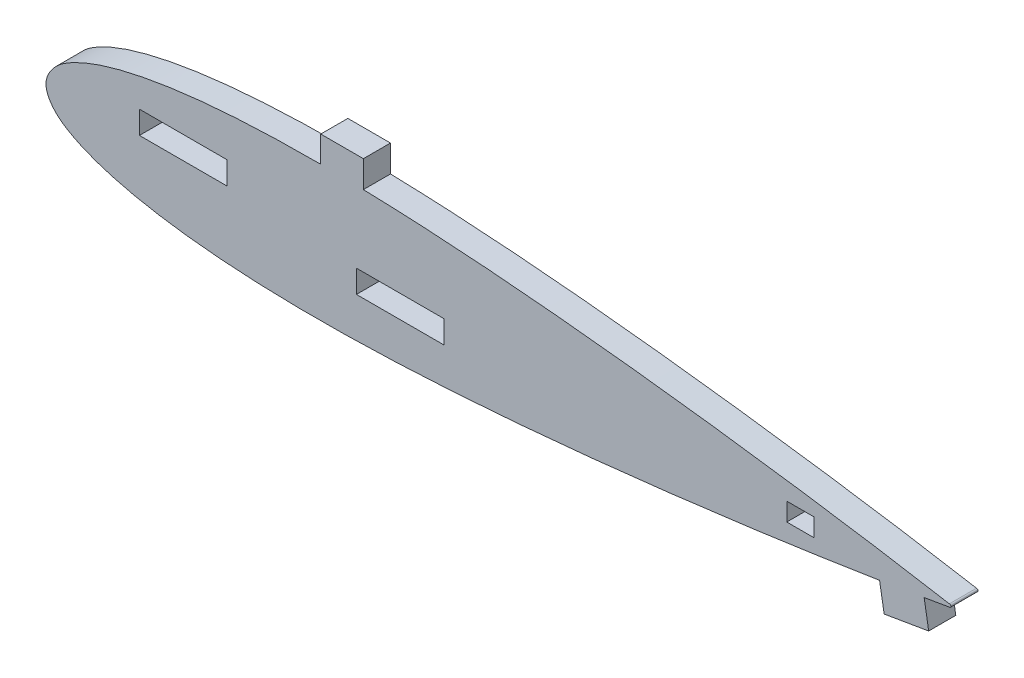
from build123d import *

# Parameters (mm, degrees)
SALIENTE_EXTRUIR1_DEPTH = 3
CROQUIS2_W              = 3
CROQUIS2_H              = 2
CROQUIS2_W_2            = 9.72
CROQUIS2_H_2            = 2.52
CORTAR_EXTRUIR1_DEPTH   = 3
CROQUIS3_W              = 4.72
CROQUIS3_H              = 3
SALIENTE_EXTRUIR2_DEPTH = 3


with BuildPart() as part:
    # Croquis1 → Saliente-Extruir1 (new body)
    with BuildSketch(Plane.XY):
        with BuildLine():
            Line((92.271945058, -1.452029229), (92.779112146, -4.43313875))
            Line((92.779112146, -4.43313875), (97.708287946, -3.594553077))
            Line((97.708287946, -3.594553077), (97.205136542, -0.637047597))
            add(Edge.make_bspline(
                [(97.205136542, -0.637047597), (98.136950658, -0.478520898), (99.068475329, -0.318260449), (100, -0.158)],
                knots=[0.986199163, 0.986199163, 0.986199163, 0.986199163, 1, 1, 1, 1], degree=3))
            ThreePointArc((100, -0.158), (100.16636323, 0), (100, 0.158))
            add(Edge.make_bspline(
                [(100, 0.158), (98.333885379, 0.444640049), (95.004226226, 1.017477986), (88.341002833, 2.082424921), (80.011350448, 3.30498548), (70.010513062, 4.607478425), (60.010644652, 5.737307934), (50.010667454, 6.660745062), (40.009104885, 7.31676529), (31.667624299, 7.547695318), (24.997182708, 7.456738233), (19.991591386, 7.209367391), (14.979141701, 6.73336712), (10.806135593, 6.066948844), (7.473446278, 5.274524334), (4.943037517, 4.479878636), (2.815749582, 3.515427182), (0.906186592, 2.239223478), (-0.575121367, 0), (0.906186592, -2.239223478), (2.815749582, -3.515427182), (4.943037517, -4.479878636), (7.473446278, -5.274524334), (10.806135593, -6.066948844), (14.979141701, -6.73336712), (19.991591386, -7.209367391), (24.997182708, -7.456738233), (31.667624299, -7.547695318), (40.009104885, -7.31676529), (50.010667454, -6.660745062), (60.010644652, -5.737307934), (70.010513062, -4.607478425), (80.011350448, -3.30498548), (87.429407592, -2.216221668), (91.514891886, -1.572991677), (92.271945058, -1.452029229)],
                knots=[0, 0, 0, 0, 0.024684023, 0.04932997, 0.098522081, 0.147602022, 0.196578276, 0.24545048, 0.2942189, 0.342903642, 0.367241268, 0.391607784, 0.416059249, 0.440726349, 0.453242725, 0.466028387, 0.479472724, 0.486972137, 0.5, 0.513027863, 0.520527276, 0.533971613, 0.546757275, 0.559273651, 0.583940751, 0.608392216, 0.632758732, 0.657096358, 0.7057811, 0.75454952, 0.803421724, 0.852397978, 0.901477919, 0.95067003, 0.961863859, 0.961863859, 0.961863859, 0.961863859], degree=3))
        make_face()
    extrude(amount=SALIENTE_EXTRUIR1_DEPTH)

    # Croquis2 → Cortar-Extruir1 (cut)
    with BuildSketch(Plane.XY.offset(3)):
        with Locations((83.499696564, 0)):
            Rectangle(CROQUIS2_W, CROQUIS2_H)
        with Locations((15.203333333, 1.49)):
            Rectangle(CROQUIS2_W_2, CROQUIS2_H_2)
        with Locations((39.223333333, -1.74)):
            Rectangle(CROQUIS2_W_2, CROQUIS2_H_2)
    extrude(amount=-CORTAR_EXTRUIR1_DEPTH, mode=Mode.SUBTRACT)

    # Croquis3 → Saliente-Extruir2 (add)
    with BuildSketch(Plane.XY.offset(3)):
        with Locations((32.773333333, 8.9)):
            Rectangle(CROQUIS3_W, CROQUIS3_H)
    extrude(amount=-SALIENTE_EXTRUIR2_DEPTH)


solid = part.part
